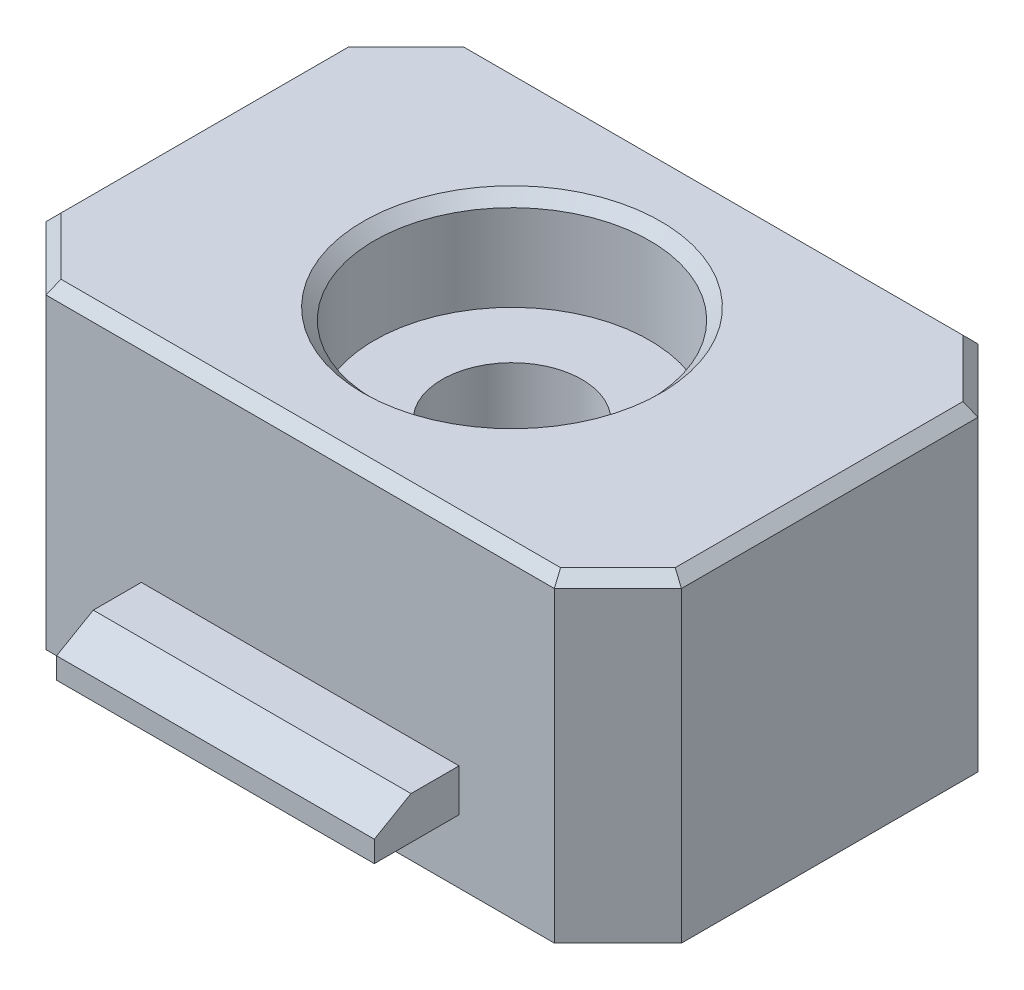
from build123d import *

# Parameters (mm, degrees)
SKETCH1_W                 = 30
SKETCH1_H                 = 20
BOSS_EXTRUDE1_DEPTH       = 15
CHAMFER1_SIZE             = 3
CHAMFER2_SIZE             = 0.5
SKETCH4_W                 = 15
SKETCH4_H                 = 4
BOSS_EXTRUDE2_DEPTH       = 2
CHAMFER3_SIZE             = 1
CHAMFER3_SIZE2            = 1.732050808
CHAMFER3_OF_MIRROR1_SIZE2 = 1
CHAMFER3_OF_MIRROR1_SIZE  = 1.732050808


with BuildPart() as part:
    # Sketch1 → Boss-Extrude1 (new body)
    with BuildSketch(Plane(origin=(0, 0, 0), x_dir=(1, 0, 0), z_dir=(0, 1, 0))):
        Rectangle(SKETCH1_W, SKETCH1_H)
    extrude(amount=BOSS_EXTRUDE1_DEPTH)

    # Chamfer1
    chamfer1_edges = [part.edges().sort_by_distance(p)[0] for p in [
        (15, 7.5, 10),
        (-15, 7.5, 10),
        (-15, 7.5, -10),
        (15, 7.5, -10),
    ]]
    chamfer(chamfer1_edges, length=CHAMFER1_SIZE)

    # Chamfer2
    chamfer2_edges = [part.edges().sort_by_distance(p)[0] for p in [
        (-15, 15, 0),
        (0, 15, -10),
        (15, 15, 0),
        (0, 15, 10),
        (-13.5, 15, 8.5),
        (13.5, 15, 8.5),
        (13.5, 15, -8.5),
        (-13.5, 15, -8.5),
    ]]
    chamfer(chamfer2_edges, length=CHAMFER2_SIZE)

    # Sketch3 → CBORE for M6 Pan Head Screw1 (revolve, cut)
    with BuildSketch(Plane(origin=(0, 15, 0), x_dir=(0, 0, 1), z_dir=(1, 0, 0))):
        Polygon((0, 0), (0, 15), (3.3, 15), (3.3, 4.6), (6.5, 4.6), (6.5, 0.525), (7.025, 0), align=None)
    revolve(axis=Axis((0, 21.35, 0), (0, -1, 0)), mode=Mode.SUBTRACT)

    # Sketch4 → Boss-Extrude2 (add)
    with BuildSketch(Plane(origin=(0, 3, 0), x_dir=(1, 0, 0), z_dir=(0, 1, 0))):
        with Locations((0, -12)):
            Rectangle(SKETCH4_W, SKETCH4_H)
    boss_extrude2 = extrude(amount=BOSS_EXTRUDE2_DEPTH)

    # Chamfer3
    chamfer3_edges = [part.edges().sort_by_distance(p)[0] for p in [
        (0, 5, 14),
    ]]
    chamfer3_side = [part.faces().sort_by_distance(p)[0] for p in [
        (0, 4, 14),
    ]]
    chamfer(chamfer3_edges, length=CHAMFER3_SIZE, length2=CHAMFER3_SIZE2, reference=chamfer3_side[0])

    # Mirror1: Boss-Extrude2 across plane
    add(boss_extrude2.mirror(Plane.XY))

    # Chamfer3 of Mirror1
    chamfer3_of_mirror1_edges = [part.edges().sort_by_distance(p)[0] for p in [
        (0, 5, -14),
    ]]
    chamfer(chamfer3_of_mirror1_edges, length=CHAMFER3_OF_MIRROR1_SIZE, length2=CHAMFER3_OF_MIRROR1_SIZE2)


solid = part.part
